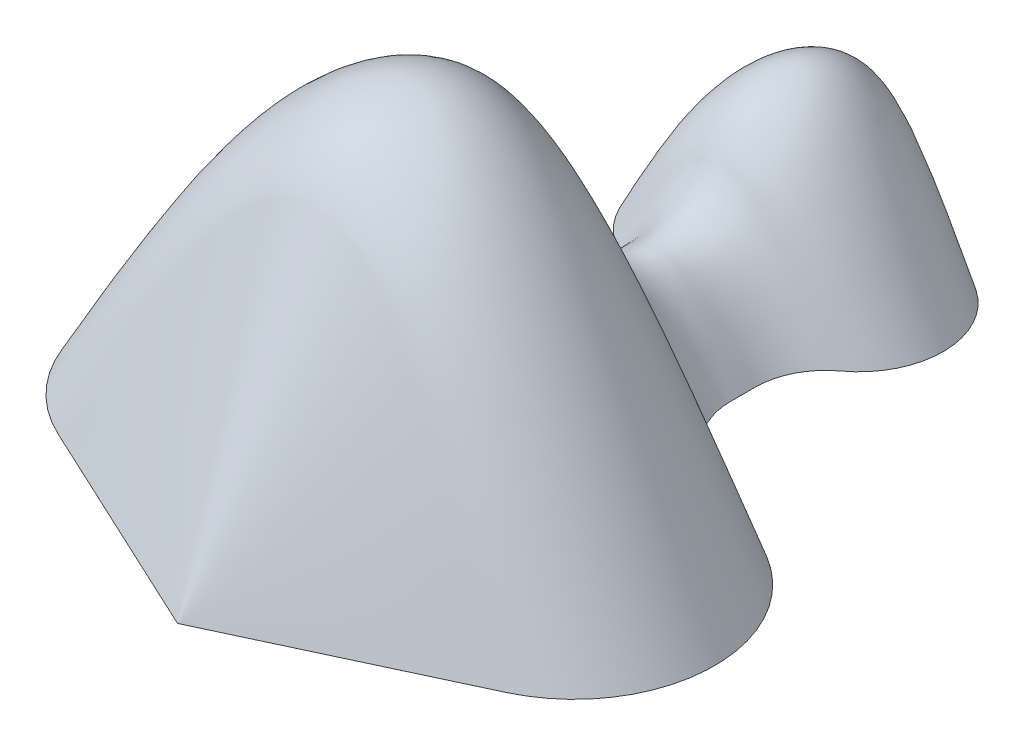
ISO-10303-21;
HEADER;
FILE_DESCRIPTION(('STEP AP214'),'2;1');
FILE_NAME('part.step','',(''),(''),'','','');
FILE_SCHEMA(('AUTOMOTIVE_DESIGN { 1 0 10303 214 1 1 1 1 }'));
ENDSEC;
DATA;
#1=APPLICATION_CONTEXT('core data for automotive mechanical design processes');
#2=APPLICATION_PROTOCOL_DEFINITION('international standard','automotive_design',2000,#1);
#3=PRODUCT_CONTEXT('',#1,'mechanical');
#4=PRODUCT('Part','Part','',(#3));
#5=PRODUCT_RELATED_PRODUCT_CATEGORY('part','',(#4));
#6=PRODUCT_DEFINITION_FORMATION('','',#4);
#7=PRODUCT_DEFINITION_CONTEXT('part definition',#1,'design');
#8=PRODUCT_DEFINITION('design','',#6,#7);
#9=PRODUCT_DEFINITION_SHAPE('','',#8);
#10=(LENGTH_UNIT() NAMED_UNIT(*) SI_UNIT(.MILLI.,.METRE.));
#11=(NAMED_UNIT(*) PLANE_ANGLE_UNIT() SI_UNIT($,.RADIAN.));
#12=(NAMED_UNIT(*) SI_UNIT($,.STERADIAN.) SOLID_ANGLE_UNIT());
#13=UNCERTAINTY_MEASURE_WITH_UNIT(LENGTH_MEASURE(1.E-05),#10,'distance_accuracy_value','');
#14=(GEOMETRIC_REPRESENTATION_CONTEXT(3) GLOBAL_UNCERTAINTY_ASSIGNED_CONTEXT((#13)) GLOBAL_UNIT_ASSIGNED_CONTEXT((#10,
#11,#12)) REPRESENTATION_CONTEXT('',''));
#15=CARTESIAN_POINT('',(0.,0.,0.));
#16=DIRECTION('',(0.,0.,1.));
#17=DIRECTION('',(1.,0.,0.));
#18=AXIS2_PLACEMENT_3D('',#15,#16,#17);
#19=CARTESIAN_POINT('',(0.,0.,-100.));
#20=CARTESIAN_POINT('',(0.,0.,-100.));
#21=CARTESIAN_POINT('',(0.,0.,-100.));
#22=CARTESIAN_POINT('',(0.,0.,-100.));
#23=CARTESIAN_POINT('',(0.,0.,-100.));
#24=CARTESIAN_POINT('',(-0.774388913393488,0.,-100.));
#25=CARTESIAN_POINT('',(-0.516259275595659,0.515822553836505,-100.));
#26=CARTESIAN_POINT('',(0.,1.54746766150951,-100.));
#27=CARTESIAN_POINT('',(0.516259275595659,0.515822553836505,-100.));
#28=CARTESIAN_POINT('',(0.774388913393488,0.,-100.));
#29=CARTESIAN_POINT('',(-2.26585521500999,0.,-100.));
#30=CARTESIAN_POINT('',(-1.51057014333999,1.60764300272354,-100.));
#31=CARTESIAN_POINT('',(0.,4.82292900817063,-100.));
#32=CARTESIAN_POINT('',(1.51057014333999,1.60764300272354,-100.));
#33=CARTESIAN_POINT('',(2.26585521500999,0.,-100.));
#34=CARTESIAN_POINT('',(-4.44269685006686,0.,-100.));
#35=CARTESIAN_POINT('',(-2.96179790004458,3.34242154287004,-100.));
#36=CARTESIAN_POINT('',(0.,10.0272646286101,-99.9999999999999));
#37=CARTESIAN_POINT('',(2.96179790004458,3.34242154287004,-100.));
#38=CARTESIAN_POINT('',(4.44269685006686,0.,-100.));
#39=CARTESIAN_POINT('',(-6.64245559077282,0.,-99.9999999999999));
#40=CARTESIAN_POINT('',(-4.42830372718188,5.02025811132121,-100.));
#41=CARTESIAN_POINT('',(0.,15.0607743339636,-100.));
#42=CARTESIAN_POINT('',(4.42830372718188,5.02025811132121,-100.));
#43=CARTESIAN_POINT('',(6.64245559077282,0.,-99.9999999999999));
#44=CARTESIAN_POINT('',(-8.18445035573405,0.,-100.));
#45=CARTESIAN_POINT('',(-5.45630023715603,6.02730723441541,-100.));
#46=CARTESIAN_POINT('',(0.,18.0819217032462,-100.));
#47=CARTESIAN_POINT('',(5.45630023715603,6.02730723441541,-100.));
#48=CARTESIAN_POINT('',(8.18445035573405,0.,-100.));
#49=CARTESIAN_POINT('',(-10.2219267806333,0.,-100.));
#50=CARTESIAN_POINT('',(-6.8146178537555,7.20822904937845,-100.));
#51=CARTESIAN_POINT('',(0.,21.6246871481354,-100.));
#52=CARTESIAN_POINT('',(6.8146178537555,7.20822904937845,-100.));
#53=CARTESIAN_POINT('',(10.2219267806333,0.,-100.));
#54=CARTESIAN_POINT('',(-12.6846448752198,0.,-99.623721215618));
#55=CARTESIAN_POINT('',(-8.4564299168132,8.60173566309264,-99.5593961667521));
#56=CARTESIAN_POINT('',(0.,25.8052069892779,-99.4307460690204));
#57=CARTESIAN_POINT('',(8.45642991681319,8.60173566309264,-99.5593961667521));
#58=CARTESIAN_POINT('',(12.6846448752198,0.,-99.6237212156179));
#59=CARTESIAN_POINT('',(-16.0726094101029,0.,-97.9380511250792));
#60=CARTESIAN_POINT('',(-10.7150729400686,10.3976911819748,-97.6808238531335));
#61=CARTESIAN_POINT('',(0.,31.1930735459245,-97.1663693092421));
#62=CARTESIAN_POINT('',(10.7150729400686,10.3976911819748,-97.6808238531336));
#63=CARTESIAN_POINT('',(16.0726094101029,0.,-97.9380511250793));
#64=CARTESIAN_POINT('',(-18.8013721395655,0.,-95.2660205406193));
#65=CARTESIAN_POINT('',(-12.5342480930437,11.7279328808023,-94.7994983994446));
#66=CARTESIAN_POINT('',(0.,35.1837986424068,-93.8664541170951));
#67=CARTESIAN_POINT('',(12.5342480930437,11.7279328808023,-94.7994983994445));
#68=CARTESIAN_POINT('',(18.8013721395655,0.,-95.2660205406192));
#69=CARTESIAN_POINT('',(-20.5762225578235,0.,-91.8588974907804));
#70=CARTESIAN_POINT('',(-13.7174817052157,12.4728874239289,-91.2194807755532));
#71=CARTESIAN_POINT('',(0.,37.4186622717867,-89.9406473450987));
#72=CARTESIAN_POINT('',(13.7174817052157,12.4728874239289,-91.2194807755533));
#73=CARTESIAN_POINT('',(20.5762225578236,0.,-91.8588974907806));
#74=CARTESIAN_POINT('',(-21.20262804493,0.,-88.0594477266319));
#75=CARTESIAN_POINT('',(-14.1350853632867,12.5680241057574,-87.3104727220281));
#76=CARTESIAN_POINT('',(0.,37.7040723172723,-85.8125227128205));
#77=CARTESIAN_POINT('',(14.1350853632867,12.5680241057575,-87.310472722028));
#78=CARTESIAN_POINT('',(21.20262804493,0.,-88.0594477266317));
#79=CARTESIAN_POINT('',(-20.6137458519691,0.,-84.2587920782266));
#80=CARTESIAN_POINT('',(-13.7424972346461,12.0046794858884,-83.4740411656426));
#81=CARTESIAN_POINT('',(0.,36.0140384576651,-81.9045393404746));
#82=CARTESIAN_POINT('',(13.7424972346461,12.0046794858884,-83.4740411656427));
#83=CARTESIAN_POINT('',(20.6137458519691,0.,-84.2587920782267));
#84=CARTESIAN_POINT('',(-18.8808683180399,0.,-80.8456178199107));
#85=CARTESIAN_POINT('',(-12.5872455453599,10.8307137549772,-80.1064854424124));
#86=CARTESIAN_POINT('',(0.,32.4921412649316,-78.6282206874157));
#87=CARTESIAN_POINT('',(12.5872455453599,10.8307137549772,-80.1064854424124));
#88=CARTESIAN_POINT('',(18.8808683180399,0.,-80.8456178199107));
#89=CARTESIAN_POINT('',(-17.094517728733,0.,-79.0542524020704));
#90=CARTESIAN_POINT('',(-11.3963451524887,9.7099041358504,-78.4117091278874));
#91=CARTESIAN_POINT('',(0.,29.1297124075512,-77.1266225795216));
#92=CARTESIAN_POINT('',(11.3963451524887,9.7099041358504,-78.4117091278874));
#93=CARTESIAN_POINT('',(17.094517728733,0.,-79.0542524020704));
#94=CARTESIAN_POINT('',(-15.4423087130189,0.,-77.8440637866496));
#95=CARTESIAN_POINT('',(-10.2948724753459,8.69087225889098,-77.3187482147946));
#96=CARTESIAN_POINT('',(0.,26.0726167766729,-76.2681170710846));
#97=CARTESIAN_POINT('',(10.2948724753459,8.69087225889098,-77.3187482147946));
#98=CARTESIAN_POINT('',(15.4423087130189,0.,-77.8440637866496));
#99=CARTESIAN_POINT('',(-14.2959649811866,0.,-76.7652941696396));
#100=CARTESIAN_POINT('',(-9.53064332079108,7.89599416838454,-76.265778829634));
#101=CARTESIAN_POINT('',(0.,23.6879825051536,-75.2667481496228));
#102=CARTESIAN_POINT('',(9.53064332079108,7.89599416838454,-76.2657788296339));
#103=CARTESIAN_POINT('',(14.2959649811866,0.,-76.7652941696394));
#104=CARTESIAN_POINT('',(-13.0206176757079,0.,-74.8481791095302));
#105=CARTESIAN_POINT('',(-8.68041178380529,6.92455305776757,-74.157172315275));
#106=CARTESIAN_POINT('',(0.,20.7736591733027,-72.7751587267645));
#107=CARTESIAN_POINT('',(8.68041178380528,6.92455305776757,-74.1571723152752));
#108=CARTESIAN_POINT('',(13.0206176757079,0.,-74.8481791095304));
#109=CARTESIAN_POINT('',(-12.2051282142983,0.,-72.6780300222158));
#110=CARTESIAN_POINT('',(-8.13675214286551,6.35429279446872,-71.7182325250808));
#111=CARTESIAN_POINT('',(0.,19.0628783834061,-69.7986375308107));
#112=CARTESIAN_POINT('',(8.13675214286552,6.35429279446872,-71.7182325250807));
#113=CARTESIAN_POINT('',(12.2051282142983,0.,-72.6780300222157));
#114=CARTESIAN_POINT('',(-12.,0.,-71.0834307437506));
#115=CARTESIAN_POINT('',(-8.,6.25,-70.0357897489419));
#116=CARTESIAN_POINT('',(0.,18.75,-67.9405077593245));
#117=CARTESIAN_POINT('',(8.00000000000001,6.25,-70.0357897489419));
#118=CARTESIAN_POINT('',(12.,0.,-71.0834307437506));
#119=CARTESIAN_POINT('',(-12.,0.,-70.0110915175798));
#120=CARTESIAN_POINT('',(-8.,6.25,-68.9636996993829));
#121=CARTESIAN_POINT('',(0.,18.75,-66.8689160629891));
#122=CARTESIAN_POINT('',(8.,6.25,-68.9636996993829));
#123=CARTESIAN_POINT('',(12.,0.,-70.0110915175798));
#124=CARTESIAN_POINT('',(-12.,0.,-69.4835741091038));
#125=CARTESIAN_POINT('',(-8.00000000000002,6.25,-68.5882930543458));
#126=CARTESIAN_POINT('',(0.,18.75,-66.7977309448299));
#127=CARTESIAN_POINT('',(8.00000000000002,6.25,-68.5882930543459));
#128=CARTESIAN_POINT('',(12.,0.,-69.4835741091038));
#129=CARTESIAN_POINT('',(-12.,0.,-68.5405174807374));
#130=CARTESIAN_POINT('',(-7.99999999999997,6.25000000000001,-67.9389906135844));
#131=CARTESIAN_POINT('',(0.,18.75,-66.7359368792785));
#132=CARTESIAN_POINT('',(7.99999999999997,6.25000000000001,-67.9389906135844));
#133=CARTESIAN_POINT('',(12.,0.,-68.5405174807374));
#134=CARTESIAN_POINT('',(-12.,0.,-67.576285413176));
#135=CARTESIAN_POINT('',(-8.00000000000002,6.24999999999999,-67.2858381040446));
#136=CARTESIAN_POINT('',(0.,18.75,-66.7049434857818));
#137=CARTESIAN_POINT('',(8.00000000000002,6.25,-67.2858381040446));
#138=CARTESIAN_POINT('',(12.,0.,-67.576285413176));
#139=CARTESIAN_POINT('',(-12.,0.,-67.0250177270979));
#140=CARTESIAN_POINT('',(-8.,6.25,-66.892813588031));
#141=CARTESIAN_POINT('',(0.,18.75,-66.6284053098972));
#142=CARTESIAN_POINT('',(8.,6.25,-66.892813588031));
#143=CARTESIAN_POINT('',(12.,0.,-67.0250177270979));
#144=CARTESIAN_POINT('',(-12.,0.,-65.7902735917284));
#145=CARTESIAN_POINT('',(-8.,6.25,-65.735249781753));
#146=CARTESIAN_POINT('',(0.,18.75,-65.6252021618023));
#147=CARTESIAN_POINT('',(8.,6.25,-65.735249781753));
#148=CARTESIAN_POINT('',(12.,0.,-65.7902735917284));
#149=CARTESIAN_POINT('',(-12.2961353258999,0.,-63.7979245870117));
#150=CARTESIAN_POINT('',(-8.1974235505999,6.36107374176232,-63.8757773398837));
#151=CARTESIAN_POINT('',(0.,19.083221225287,-64.0314828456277));
#152=CARTESIAN_POINT('',(8.1974235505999,6.36107374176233,-63.8757773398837));
#153=CARTESIAN_POINT('',(12.2961353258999,0.,-63.7979245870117));
#154=CARTESIAN_POINT('',(-13.5894949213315,0.,-61.1086601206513));
#155=CARTESIAN_POINT('',(-9.05966328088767,6.86991791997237,-61.2873734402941));
#156=CARTESIAN_POINT('',(0.,20.6097537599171,-61.6448000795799));
#157=CARTESIAN_POINT('',(9.05966328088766,6.86991791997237,-61.2873734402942));
#158=CARTESIAN_POINT('',(13.5894949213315,0.,-61.1086601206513));
#159=CARTESIAN_POINT('',(-15.1887272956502,0.,-59.3553454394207));
#160=CARTESIAN_POINT('',(-10.1258181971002,7.59913996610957,-59.4689105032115));
#161=CARTESIAN_POINT('',(0.,22.7974198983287,-59.6960406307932));
#162=CARTESIAN_POINT('',(10.1258181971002,7.59913996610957,-59.4689105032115));
#163=CARTESIAN_POINT('',(15.1887272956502,0.,-59.3553454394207));
#164=CARTESIAN_POINT('',(-16.6346421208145,0.,-58.3022512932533));
#165=CARTESIAN_POINT('',(-11.0897614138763,8.39459200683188,-58.2917984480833));
#166=CARTESIAN_POINT('',(0.,25.1837760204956,-58.2708927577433));
#167=CARTESIAN_POINT('',(11.0897614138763,8.39459200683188,-58.2917984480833));
#168=CARTESIAN_POINT('',(16.6346421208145,0.,-58.3022512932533));
#169=CARTESIAN_POINT('',(-17.3909465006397,0.,-57.8904684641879));
#170=CARTESIAN_POINT('',(-11.5939643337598,8.87345501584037,-57.8074742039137));
#171=CARTESIAN_POINT('',(0.,26.6203650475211,-57.6414856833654));
#172=CARTESIAN_POINT('',(11.5939643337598,8.87345501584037,-57.8074742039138));
#173=CARTESIAN_POINT('',(17.3909465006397,0.,-57.8904684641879));
#174=CARTESIAN_POINT('',(-19.0437121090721,0.,-57.1197712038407));
#175=CARTESIAN_POINT('',(-12.6958080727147,10.0107239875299,-56.8918083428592));
#176=CARTESIAN_POINT('',(0.,30.0321719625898,-56.4358826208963));
#177=CARTESIAN_POINT('',(12.6958080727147,10.0107239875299,-56.8918083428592));
#178=CARTESIAN_POINT('',(19.043712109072,0.,-57.1197712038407));
#179=CARTESIAN_POINT('',(-21.3629984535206,0.,-56.03827021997));
#180=CARTESIAN_POINT('',(-14.2419989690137,11.9906551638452,-55.4278007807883));
#181=CARTESIAN_POINT('',(0.,35.9719654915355,-54.2068619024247));
#182=CARTESIAN_POINT('',(14.2419989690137,11.9906551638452,-55.4278007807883));
#183=CARTESIAN_POINT('',(21.3629984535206,0.,-56.03827021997));
#184=CARTESIAN_POINT('',(-24.6491124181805,0.,-54.505930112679));
#185=CARTESIAN_POINT('',(-16.4327416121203,15.5042508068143,-53.0232141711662));
#186=CARTESIAN_POINT('',(0.,46.5127524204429,-50.0577822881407));
#187=CARTESIAN_POINT('',(16.4327416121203,15.5042508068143,-53.0232141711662));
#188=CARTESIAN_POINT('',(24.6491124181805,0.,-54.505930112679));
#189=CARTESIAN_POINT('',(-28.0044392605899,0.,-52.9413155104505));
#190=CARTESIAN_POINT('',(-18.6696261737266,18.5466732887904,-50.8222019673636));
#191=CARTESIAN_POINT('',(0.,55.6400198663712,-46.5839748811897));
#192=CARTESIAN_POINT('',(18.6696261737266,18.5466732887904,-50.8222019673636));
#193=CARTESIAN_POINT('',(28.0044392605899,0.,-52.9413155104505));
#194=CARTESIAN_POINT('',(-30.4647927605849,0.,-51.7940338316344));
#195=CARTESIAN_POINT('',(-20.3098618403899,20.1056858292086,-49.5215816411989));
#196=CARTESIAN_POINT('',(0.,60.3170574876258,-44.9766772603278));
#197=CARTESIAN_POINT('',(20.3098618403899,20.1056858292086,-49.5215816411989));
#198=CARTESIAN_POINT('',(30.4647927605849,0.,-51.7940338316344));
#199=CARTESIAN_POINT('',(-32.6906436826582,0.,-50.7561025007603));
#200=CARTESIAN_POINT('',(-21.7937624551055,21.1963396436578,-48.4940357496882));
#201=CARTESIAN_POINT('',(0.,63.5890189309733,-43.9699022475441));
#202=CARTESIAN_POINT('',(21.7937624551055,21.1963396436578,-48.4940357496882));
#203=CARTESIAN_POINT('',(32.6906436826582,0.,-50.7561025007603));
#204=CARTESIAN_POINT('',(-34.2486995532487,0.,-49.9020278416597));
#205=CARTESIAN_POINT('',(-22.8324663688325,21.9065850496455,-47.6555930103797));
#206=CARTESIAN_POINT('',(0.,65.7197551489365,-43.1627233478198));
#207=CARTESIAN_POINT('',(22.8324663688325,21.9065850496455,-47.6555930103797));
#208=CARTESIAN_POINT('',(34.2486995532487,0.,-49.9020278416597));
#209=CARTESIAN_POINT('',(-37.1784917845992,0.,-47.7416347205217));
#210=CARTESIAN_POINT('',(-24.7856611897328,23.0944772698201,-45.6099873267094));
#211=CARTESIAN_POINT('',(0.,69.2834318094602,-41.3466925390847));
#212=CARTESIAN_POINT('',(24.7856611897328,23.0944772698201,-45.6099873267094));
#213=CARTESIAN_POINT('',(37.1784917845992,0.,-47.7416347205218));
#214=CARTESIAN_POINT('',(-40.3416140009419,0.,-44.2087228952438));
#215=CARTESIAN_POINT('',(-26.8944093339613,24.1926246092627,-42.4379104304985));
#216=CARTESIAN_POINT('',(0.,72.5778738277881,-38.896285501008));
#217=CARTESIAN_POINT('',(26.8944093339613,24.1926246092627,-42.4379104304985));
#218=CARTESIAN_POINT('',(40.3416140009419,0.,-44.2087228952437));
#219=CARTESIAN_POINT('',(-42.8607304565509,0.,-38.8943915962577));
#220=CARTESIAN_POINT('',(-28.5738203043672,24.9654817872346,-37.9130346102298));
#221=CARTESIAN_POINT('',(0.,74.8964453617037,-35.950320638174));
#222=CARTESIAN_POINT('',(28.5738203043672,24.9654817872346,-37.9130346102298));
#223=CARTESIAN_POINT('',(42.8607304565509,0.,-38.8943915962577));
#224=CARTESIAN_POINT('',(-43.7407287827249,0.,-32.9758156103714));
#225=CARTESIAN_POINT('',(-29.1604858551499,25.2223207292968,-33.0007446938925));
#226=CARTESIAN_POINT('',(0.,75.6669621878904,-33.0506028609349));
#227=CARTESIAN_POINT('',(29.16048585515,25.2223207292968,-33.0007446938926));
#228=CARTESIAN_POINT('',(43.7407287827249,0.,-32.9758156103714));
#229=CARTESIAN_POINT('',(-42.8470206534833,0.,-27.0630782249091));
#230=CARTESIAN_POINT('',(-28.5646804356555,24.9720134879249,-28.089509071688));
#231=CARTESIAN_POINT('',(0.,74.9160404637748,-30.1423707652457));
#232=CARTESIAN_POINT('',(28.5646804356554,24.9720134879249,-28.089509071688));
#233=CARTESIAN_POINT('',(42.8470206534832,0.,-27.0630782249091));
#234=CARTESIAN_POINT('',(-40.3215862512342,0.,-21.7634395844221));
#235=CARTESIAN_POINT('',(-26.8810575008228,24.2037960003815,-23.5665359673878));
#236=CARTESIAN_POINT('',(0.,72.6113880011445,-27.1727287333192));
#237=CARTESIAN_POINT('',(26.8810575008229,24.2037960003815,-23.5665359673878));
#238=CARTESIAN_POINT('',(40.3215862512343,0.,-21.7634395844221));
#239=CARTESIAN_POINT('',(-37.1623501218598,0.,-18.2446277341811));
#240=CARTESIAN_POINT('',(-24.7749000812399,23.1059507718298,-20.3943414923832));
#241=CARTESIAN_POINT('',(0.,69.3178523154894,-24.6937690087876));
#242=CARTESIAN_POINT('',(24.7749000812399,23.1059507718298,-20.3943414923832));
#243=CARTESIAN_POINT('',(37.1623501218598,0.,-18.2446277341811));
#244=CARTESIAN_POINT('',(-34.2405562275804,0.,-16.0932366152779));
#245=CARTESIAN_POINT('',(-22.8270374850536,21.9139270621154,-18.3466762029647));
#246=CARTESIAN_POINT('',(0.,65.7417811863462,-22.8535553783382));
#247=CARTESIAN_POINT('',(22.8270374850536,21.9139270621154,-18.3466762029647));
#248=CARTESIAN_POINT('',(34.2405562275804,0.,-16.0932366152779));
#249=CARTESIAN_POINT('',(-32.68741309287,0.,-15.2423910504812));
#250=CARTESIAN_POINT('',(-21.79160872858,21.1995073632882,-17.5066881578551));
#251=CARTESIAN_POINT('',(0.,63.5985220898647,-22.035282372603));
#252=CARTESIAN_POINT('',(21.79160872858,21.1995073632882,-17.5066881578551));
#253=CARTESIAN_POINT('',(32.68741309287,0.,-15.2423910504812));
#254=CARTESIAN_POINT('',(-28.9720615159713,0.,-13.5098941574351));
#255=CARTESIAN_POINT('',(-19.3147076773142,19.3566745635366,-15.7811126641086));
#256=CARTESIAN_POINT('',(0.,58.0700236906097,-20.3235496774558));
#257=CARTESIAN_POINT('',(19.3147076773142,19.3566745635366,-15.7811126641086));
#258=CARTESIAN_POINT('',(28.9720615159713,0.,-13.5098941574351));
#259=CARTESIAN_POINT('',(-23.4204814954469,0.,-10.9211498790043));
#260=CARTESIAN_POINT('',(-15.6136543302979,16.2610471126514,-13.0432257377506));
#261=CARTESIAN_POINT('',(0.,48.7831413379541,-17.2873774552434));
#262=CARTESIAN_POINT('',(15.6136543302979,16.2610471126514,-13.0432257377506));
#263=CARTESIAN_POINT('',(23.4204814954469,0.,-10.9211498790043));
#264=CARTESIAN_POINT('',(-15.5306527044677,0.,-7.24206229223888));
#265=CARTESIAN_POINT('',(-10.3537684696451,11.0329755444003,-8.76579213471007));
#266=CARTESIAN_POINT('',(0.,33.0989266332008,-11.8132518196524));
#267=CARTESIAN_POINT('',(10.3537684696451,11.0329755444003,-8.76579213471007));
#268=CARTESIAN_POINT('',(15.5306527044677,0.,-7.24206229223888));
#269=CARTESIAN_POINT('',(-7.81337068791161,0.,-3.64343458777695));
#270=CARTESIAN_POINT('',(-5.20891379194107,5.43172449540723,-4.35457202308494));
#271=CARTESIAN_POINT('',(0.,16.2951734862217,-5.77684689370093));
#272=CARTESIAN_POINT('',(5.20891379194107,5.43172449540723,-4.35457202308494));
#273=CARTESIAN_POINT('',(7.81337068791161,0.,-3.64343458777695));
#274=CARTESIAN_POINT('',(-2.63596924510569,0.,-1.22917264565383));
#275=CARTESIAN_POINT('',(-1.75731283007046,1.75741771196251,-1.43408366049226));
#276=CARTESIAN_POINT('',(0.,5.27225313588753,-1.84390569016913));
#277=CARTESIAN_POINT('',(1.75731283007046,1.75741771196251,-1.43408366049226));
#278=CARTESIAN_POINT('',(2.63596924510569,0.,-1.22917264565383));
#279=CARTESIAN_POINT('',(0.,0.,0.));
#280=CARTESIAN_POINT('',(0.,0.,0.));
#281=CARTESIAN_POINT('',(0.,0.,0.));
#282=CARTESIAN_POINT('',(0.,0.,0.));
#283=CARTESIAN_POINT('',(0.,0.,0.));
#284=B_SPLINE_SURFACE_WITH_KNOTS('',3,3,((#19,#20,#21,#22,#23),(#24,#25,#26,#27,#28),(#29,#30,
#31,#32,#33),(#34,#35,#36,#37,#38),(#39,#40,#41,#42,#43),(#44,#45,#46,#47,#48),(#49,#50,#51,#52,
#53),(#54,#55,#56,#57,#58),(#59,#60,#61,#62,#63),(#64,#65,#66,#67,#68),(#69,#70,#71,#72,#73),
(#74,#75,#76,#77,#78),(#79,#80,#81,#82,#83),(#84,#85,#86,#87,#88),(#89,#90,#91,#92,#93),(#94,
#95,#96,#97,#98),(#99,#100,#101,#102,#103),(#104,#105,#106,#107,#108),(#109,#110,#111,#112,
#113),(#114,#115,#116,#117,#118),(#119,#120,#121,#122,#123),(#124,#125,#126,#127,#128),(#129,
#130,#131,#132,#133),(#134,#135,#136,#137,#138),(#139,#140,#141,#142,#143),(#144,#145,#146,#147,
#148),(#149,#150,#151,#152,#153),(#154,#155,#156,#157,#158),(#159,#160,#161,#162,#163),(#164,
#165,#166,#167,#168),(#169,#170,#171,#172,#173),(#174,#175,#176,#177,#178),(#179,#180,#181,#182,
#183),(#184,#185,#186,#187,#188),(#189,#190,#191,#192,#193),(#194,#195,#196,#197,#198),(#199,
#200,#201,#202,#203),(#204,#205,#206,#207,#208),(#209,#210,#211,#212,#213),(#214,#215,#216,#217,
#218),(#219,#220,#221,#222,#223),(#224,#225,#226,#227,#228),(#229,#230,#231,#232,#233),(#234,
#235,#236,#237,#238),(#239,#240,#241,#242,#243),(#244,#245,#246,#247,#248),(#249,#250,#251,#252,
#253),(#254,#255,#256,#257,#258),(#259,#260,#261,#262,#263),(#264,#265,#266,#267,#268),(#269,
#270,#271,#272,#273),(#274,#275,#276,#277,#278),(#279,#280,#281,#282,#283)),.UNSPECIFIED.,.F.,
.F.,.F.,(4,1,1,1,2,1,1,1,1,1,1,1,2,1,1,1,2,1,1,1,2,1,1,1,1,2,1,1,1,2,1,1,1,1,1,1,1,1,1,2,1,1,1,
4),(4,1,4),(0.,0.0156358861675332,0.0312717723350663,0.0469076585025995,0.0625435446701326,
0.0859705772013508,0.109397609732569,0.132824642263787,0.156251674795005,0.179678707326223,
0.203105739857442,0.22653277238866,0.249959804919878,0.265099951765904,0.28024009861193,
0.295380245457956,0.310520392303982,0.314901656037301,0.31928291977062,0.323664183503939,
0.328045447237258,0.34530253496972,0.362559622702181,0.379816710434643,0.388445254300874,
0.397073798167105,0.425692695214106,0.454311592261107,0.482930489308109,0.51154938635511,
0.527406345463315,0.543263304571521,0.574977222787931,0.606691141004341,0.638405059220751,
0.670118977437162,0.701832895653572,0.733546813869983,0.749403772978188,0.765260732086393,
0.823945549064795,0.882630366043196,0.941315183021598,1.),(0.,0.5,1.),.UNSPECIFIED.);
#285=DIRECTION('',(-1.,0.,0.));
#286=VECTOR('',#285,1.);
#287=CARTESIAN_POINT('',(0.,0.,-100.));
#288=LINE('',#287,#286);
#289=CARTESIAN_POINT('',(0.,0.,-100.));
#290=VERTEX_POINT('',#289);
#291=CARTESIAN_POINT('',(-8.99999999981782,0.,-100.));
#292=VERTEX_POINT('',#291);
#293=EDGE_CURVE('E12',#290,#292,#288,.T.);
#294=CARTESIAN_POINT('',(-9.,0.,-88.));
#295=DIRECTION('',(0.,1.,0.));
#296=DIRECTION('',(0.,0.,1.));
#297=AXIS2_PLACEMENT_3D('',#294,#295,#296);
#298=CIRCLE('',#297,12.);
#299=CARTESIAN_POINT('',(-16.0909090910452,0.,-78.3191421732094));
#300=VERTEX_POINT('',#299);
#301=EDGE_CURVE('E160',#292,#300,#298,.T.);
#302=CARTESIAN_POINT('',(-22.,0.,-70.2517606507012));
#303=DIRECTION('',(0.,-1.,0.));
#304=DIRECTION('',(0.,0.,-1.));
#305=AXIS2_PLACEMENT_3D('',#302,#303,#304);
#306=CIRCLE('',#305,9.99999999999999);
#307=CARTESIAN_POINT('',(-12.,0.,-70.2517606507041));
#308=VERTEX_POINT('',#307);
#309=EDGE_CURVE('E344',#300,#308,#306,.T.);
#310=DIRECTION('',(0.,0.,1.));
#311=VECTOR('',#310,1.);
#312=CARTESIAN_POINT('',(-12.,0.,-66.7750107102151));
#313=LINE('',#312,#311);
#314=CARTESIAN_POINT('',(-12.,0.,-66.7750107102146));
#315=VERTEX_POINT('',#314);
#316=EDGE_CURVE('E316',#308,#315,#313,.T.);
#317=CARTESIAN_POINT('',(-22.,0.,-66.775010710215));
#318=DIRECTION('',(0.,-1.,0.));
#319=DIRECTION('',(0.,0.,-1.));
#320=AXIS2_PLACEMENT_3D('',#317,#318,#319);
#321=CIRCLE('',#320,10.);
#322=CARTESIAN_POINT('',(-17.7738173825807,0.,-57.7119328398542));
#323=VERTEX_POINT('',#322);
#324=EDGE_CURVE('E313',#315,#323,#321,.T.);
#325=DIRECTION('',(-0.90630778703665,0.,0.422618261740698));
#326=VECTOR('',#325,1.);
#327=CARTESIAN_POINT('',(-31.8970619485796,0.,-51.126155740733));
#328=LINE('',#327,#326);
#329=CARTESIAN_POINT('',(-31.8970619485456,0.,-51.1261557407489));
#330=VERTEX_POINT('',#329);
#331=EDGE_CURVE('E317',#323,#330,#328,.T.);
#332=CARTESIAN_POINT('',(-23.4446967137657,0.,-33.));
#333=DIRECTION('',(0.,1.,0.));
#334=DIRECTION('',(0.,0.,-1.));
#335=AXIS2_PLACEMENT_3D('',#332,#333,#334);
#336=CIRCLE('',#335,20.);
#337=CARTESIAN_POINT('',(-31.8970619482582,0.,-14.8738442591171));
#338=VERTEX_POINT('',#337);
#339=EDGE_CURVE('E227',#330,#338,#336,.T.);
#340=DIRECTION('',(0.906307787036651,0.,0.422618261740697));
#341=VECTOR('',#340,1.);
#342=CARTESIAN_POINT('',(0.,0.,0.));
#343=LINE('',#342,#341);
#344=CARTESIAN_POINT('',(0.,0.,0.));
#345=VERTEX_POINT('',#344);
#346=EDGE_CURVE('E224',#338,#345,#343,.T.);
#347=DIRECTION('',(-0.906307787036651,0.,0.422618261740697));
#348=VECTOR('',#347,1.);
#349=CARTESIAN_POINT('',(0.,0.,0.));
#350=LINE('',#349,#348);
#351=CARTESIAN_POINT('',(31.8970619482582,0.,-14.8738442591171));
#352=VERTEX_POINT('',#351);
#353=EDGE_CURVE('E168',#352,#345,#350,.T.);
#354=CARTESIAN_POINT('',(23.4446967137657,0.,-33.));
#355=DIRECTION('',(0.,-1.,0.));
#356=DIRECTION('',(0.,0.,1.));
#357=AXIS2_PLACEMENT_3D('',#354,#355,#356);
#358=CIRCLE('',#357,20.);
#359=CARTESIAN_POINT('',(31.8970619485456,0.,-51.1261557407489));
#360=VERTEX_POINT('',#359);
#361=EDGE_CURVE('E154',#360,#352,#358,.T.);
#362=DIRECTION('',(0.90630778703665,0.,0.422618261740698));
#363=VECTOR('',#362,1.);
#364=CARTESIAN_POINT('',(31.8970619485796,0.,-51.126155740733));
#365=LINE('',#364,#363);
#366=CARTESIAN_POINT('',(17.7738173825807,0.,-57.7119328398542));
#367=VERTEX_POINT('',#366);
#368=EDGE_CURVE('E469',#367,#360,#365,.T.);
#369=CARTESIAN_POINT('',(22.,0.,-66.775010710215));
#370=DIRECTION('',(0.,1.,0.));
#371=DIRECTION('',(0.,0.,1.));
#372=AXIS2_PLACEMENT_3D('',#369,#370,#371);
#373=CIRCLE('',#372,10.);
#374=CARTESIAN_POINT('',(12.,0.,-66.7750107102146));
#375=VERTEX_POINT('',#374);
#376=EDGE_CURVE('E439',#375,#367,#373,.T.);
#377=DIRECTION('',(0.,0.,1.));
#378=VECTOR('',#377,1.);
#379=CARTESIAN_POINT('',(12.,0.,-66.7750107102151));
#380=LINE('',#379,#378);
#381=CARTESIAN_POINT('',(12.,0.,-70.2517606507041));
#382=VERTEX_POINT('',#381);
#383=EDGE_CURVE('E436',#382,#375,#380,.T.);
#384=CARTESIAN_POINT('',(22.,0.,-70.2517606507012));
#385=DIRECTION('',(0.,1.,0.));
#386=DIRECTION('',(0.,0.,1.));
#387=AXIS2_PLACEMENT_3D('',#384,#385,#386);
#388=CIRCLE('',#387,9.99999999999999);
#389=CARTESIAN_POINT('',(16.0909090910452,0.,-78.3191421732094));
#390=VERTEX_POINT('',#389);
#391=EDGE_CURVE('E414',#390,#382,#388,.T.);
#392=CARTESIAN_POINT('',(9.,0.,-88.));
#393=DIRECTION('',(0.,1.,0.));
#394=DIRECTION('',(0.,0.,-1.));
#395=AXIS2_PLACEMENT_3D('',#392,#393,#394);
#396=CIRCLE('',#395,12.);
#397=CARTESIAN_POINT('',(8.99999999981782,0.,-100.));
#398=VERTEX_POINT('',#397);
#399=EDGE_CURVE('E382',#398,#390,#396,.F.);
#400=DIRECTION('',(1.,0.,0.));
#401=VECTOR('',#400,1.);
#402=CARTESIAN_POINT('',(0.,0.,-100.));
#403=LINE('',#402,#401);
#404=EDGE_CURVE('E238',#290,#398,#403,.T.);
#405=ORIENTED_EDGE('',*,*,#293,.T.);
#406=ORIENTED_EDGE('',*,*,#301,.T.);
#407=ORIENTED_EDGE('',*,*,#309,.T.);
#408=ORIENTED_EDGE('',*,*,#316,.T.);
#409=ORIENTED_EDGE('',*,*,#324,.T.);
#410=ORIENTED_EDGE('',*,*,#331,.T.);
#411=ORIENTED_EDGE('',*,*,#339,.T.);
#412=ORIENTED_EDGE('',*,*,#346,.T.);
#413=ORIENTED_EDGE('',*,*,#353,.F.);
#414=ORIENTED_EDGE('',*,*,#361,.F.);
#415=ORIENTED_EDGE('',*,*,#368,.F.);
#416=ORIENTED_EDGE('',*,*,#376,.F.);
#417=ORIENTED_EDGE('',*,*,#383,.F.);
#418=ORIENTED_EDGE('',*,*,#391,.F.);
#419=ORIENTED_EDGE('',*,*,#399,.F.);
#420=ORIENTED_EDGE('',*,*,#404,.F.);
#421=EDGE_LOOP('',(#405,#406,#407,#408,#409,#410,#411,#412,#413,#414,#415,#416,#417,#418,#419,#420));
#422=FACE_BOUND('',#421,.T.);
#423=ADVANCED_FACE('F149',(#422),#284,.T.);
#424=CARTESIAN_POINT('',(-30.252178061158,0.,-51.8931776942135));
#425=DIRECTION('',(0.,-1.,0.));
#426=DIRECTION('',(0.,0.,-1.));
#427=AXIS2_PLACEMENT_3D('',#424,#425,#426);
#428=PLANE('',#427);
#429=ORIENTED_EDGE('',*,*,#293,.F.);
#430=DIRECTION('',(0.,0.,-1.));
#431=VECTOR('',#430,1.);
#432=CARTESIAN_POINT('',(0.,0.,0.));
#433=LINE('',#432,#431);
#434=EDGE_CURVE('E218',#345,#290,#433,.T.);
#435=ORIENTED_EDGE('',*,*,#434,.F.);
#436=ORIENTED_EDGE('',*,*,#346,.F.);
#437=ORIENTED_EDGE('',*,*,#339,.F.);
#438=ORIENTED_EDGE('',*,*,#331,.F.);
#439=ORIENTED_EDGE('',*,*,#324,.F.);
#440=ORIENTED_EDGE('',*,*,#316,.F.);
#441=ORIENTED_EDGE('',*,*,#309,.F.);
#442=ORIENTED_EDGE('',*,*,#301,.F.);
#443=EDGE_LOOP('',(#429,#435,#436,#437,#438,#439,#440,#441,#442));
#444=FACE_BOUND('',#443,.T.);
#445=ADVANCED_FACE('F235',(#444),#428,.T.);
#446=CARTESIAN_POINT('',(30.252178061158,0.,-51.8931776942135));
#447=DIRECTION('',(0.,1.,0.));
#448=DIRECTION('',(0.,0.,1.));
#449=AXIS2_PLACEMENT_3D('',#446,#447,#448);
#450=PLANE('',#449);
#451=ORIENTED_EDGE('',*,*,#434,.T.);
#452=ORIENTED_EDGE('',*,*,#404,.T.);
#453=ORIENTED_EDGE('',*,*,#399,.T.);
#454=ORIENTED_EDGE('',*,*,#391,.T.);
#455=ORIENTED_EDGE('',*,*,#383,.T.);
#456=ORIENTED_EDGE('',*,*,#376,.T.);
#457=ORIENTED_EDGE('',*,*,#368,.T.);
#458=ORIENTED_EDGE('',*,*,#361,.T.);
#459=ORIENTED_EDGE('',*,*,#353,.T.);
#460=EDGE_LOOP('',(#451,#452,#453,#454,#455,#456,#457,#458,#459));
#461=FACE_BOUND('',#460,.T.);
#462=ADVANCED_FACE('F151',(#461),#450,.F.);
#463=CLOSED_SHELL('',(#423,#445,#462));
#464=MANIFOLD_SOLID_BREP('B2',#463);
#465=ADVANCED_BREP_SHAPE_REPRESENTATION('',(#18,#464),#14);
#466=SHAPE_DEFINITION_REPRESENTATION(#9,#465);
ENDSEC;
END-ISO-10303-21;
